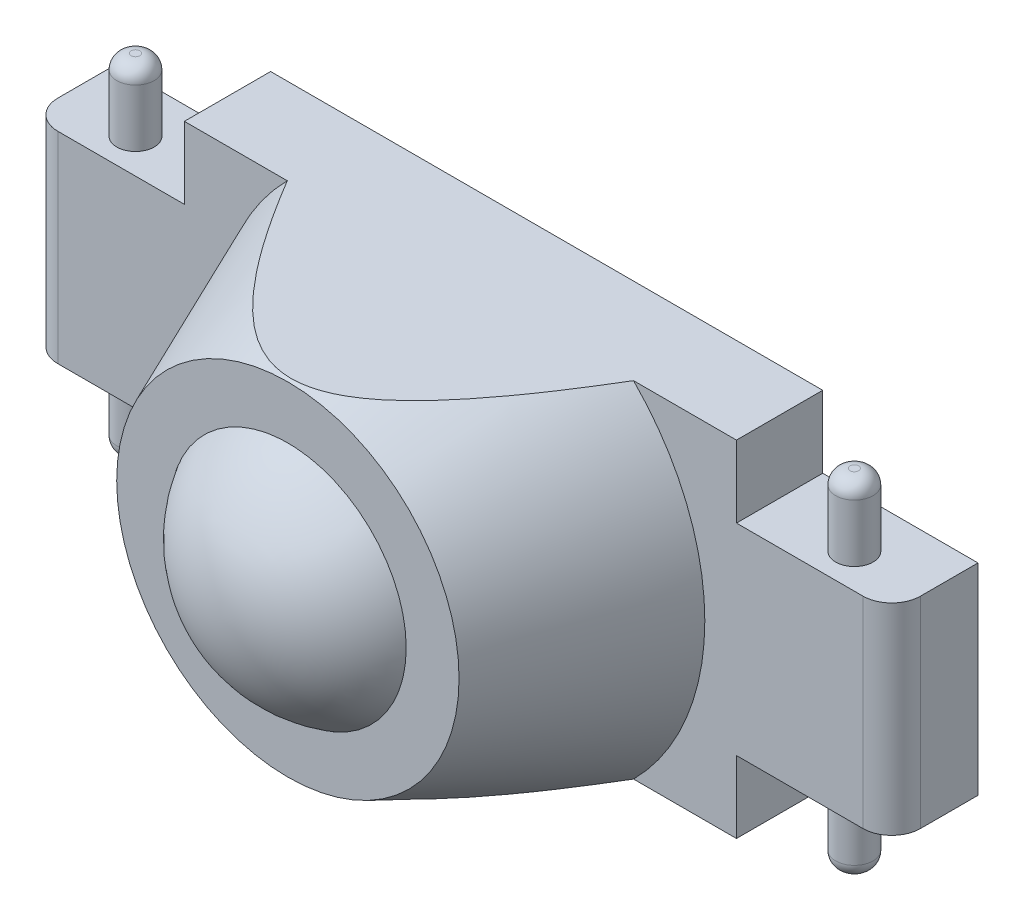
ISO-10303-21;
HEADER;
FILE_DESCRIPTION(('STEP AP214'),'2;1');
FILE_NAME('part.step','',(''),(''),'','','');
FILE_SCHEMA(('AUTOMOTIVE_DESIGN { 1 0 10303 214 1 1 1 1 }'));
ENDSEC;
DATA;
#1=APPLICATION_CONTEXT('core data for automotive mechanical design processes');
#2=APPLICATION_PROTOCOL_DEFINITION('international standard','automotive_design',2000,#1);
#3=PRODUCT_CONTEXT('',#1,'mechanical');
#4=PRODUCT('Part','Part','',(#3));
#5=PRODUCT_RELATED_PRODUCT_CATEGORY('part','',(#4));
#6=PRODUCT_DEFINITION_FORMATION('','',#4);
#7=PRODUCT_DEFINITION_CONTEXT('part definition',#1,'design');
#8=PRODUCT_DEFINITION('design','',#6,#7);
#9=PRODUCT_DEFINITION_SHAPE('','',#8);
#10=(LENGTH_UNIT() NAMED_UNIT(*) SI_UNIT(.MILLI.,.METRE.));
#11=(NAMED_UNIT(*) PLANE_ANGLE_UNIT() SI_UNIT($,.RADIAN.));
#12=(NAMED_UNIT(*) SI_UNIT($,.STERADIAN.) SOLID_ANGLE_UNIT());
#13=UNCERTAINTY_MEASURE_WITH_UNIT(LENGTH_MEASURE(1.E-05),#10,'distance_accuracy_value','');
#14=(GEOMETRIC_REPRESENTATION_CONTEXT(3) GLOBAL_UNCERTAINTY_ASSIGNED_CONTEXT((#13)) GLOBAL_UNIT_ASSIGNED_CONTEXT((#10,
#11,#12)) REPRESENTATION_CONTEXT('',''));
#15=CARTESIAN_POINT('',(0.,0.,0.));
#16=DIRECTION('',(0.,0.,1.));
#17=DIRECTION('',(1.,0.,0.));
#18=AXIS2_PLACEMENT_3D('',#15,#16,#17);
#19=CARTESIAN_POINT('',(12.5,6.,1.8));
#20=DIRECTION('',(0.,-1.,0.));
#21=DIRECTION('',(0.,0.,-1.));
#22=AXIS2_PLACEMENT_3D('',#19,#20,#21);
#23=CYLINDRICAL_SURFACE('',#22,0.649999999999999);
#24=CARTESIAN_POINT('',(12.5,-5.5,1.8));
#25=DIRECTION('',(0.,1.,0.));
#26=DIRECTION('',(0.,0.,1.));
#27=AXIS2_PLACEMENT_3D('',#24,#25,#26);
#28=CIRCLE('',#27,0.649999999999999);
#29=CARTESIAN_POINT('',(12.5,-5.5,2.45));
#30=VERTEX_POINT('',#29);
#31=EDGE_CURVE('E49',#30,#30,#28,.T.);
#32=ORIENTED_EDGE('',*,*,#31,.T.);
#33=EDGE_LOOP('',(#32));
#34=FACE_BOUND('',#33,.T.);
#35=CARTESIAN_POINT('',(12.5,5.5,1.8));
#36=DIRECTION('',(0.,1.,0.));
#37=DIRECTION('',(0.,0.,1.));
#38=AXIS2_PLACEMENT_3D('',#35,#36,#37);
#39=CIRCLE('',#38,0.649999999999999);
#40=CARTESIAN_POINT('',(12.5,5.5,2.45));
#41=VERTEX_POINT('',#40);
#42=EDGE_CURVE('E53',#41,#41,#39,.F.);
#43=ORIENTED_EDGE('',*,*,#42,.T.);
#44=EDGE_LOOP('',(#43));
#45=FACE_BOUND('',#44,.T.);
#46=ADVANCED_FACE('F38',(#34,#45),#23,.T.);
#47=CARTESIAN_POINT('',(12.5,6.,1.8));
#48=DIRECTION('',(0.,1.,0.));
#49=DIRECTION('',(0.,0.,1.));
#50=AXIS2_PLACEMENT_3D('',#47,#48,#49);
#51=PLANE('',#50);
#52=CARTESIAN_POINT('',(12.5,6.,1.8));
#53=DIRECTION('',(0.,1.,0.));
#54=DIRECTION('',(0.,0.,1.));
#55=AXIS2_PLACEMENT_3D('',#52,#53,#54);
#56=CIRCLE('',#55,0.149999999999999);
#57=CARTESIAN_POINT('',(12.5,6.,1.95));
#58=VERTEX_POINT('',#57);
#59=EDGE_CURVE('E11',#58,#58,#56,.T.);
#60=ORIENTED_EDGE('',*,*,#59,.T.);
#61=EDGE_LOOP('',(#60));
#62=FACE_BOUND('',#61,.T.);
#63=ADVANCED_FACE('F69',(#62),#51,.T.);
#64=CARTESIAN_POINT('',(12.5,-6.,1.8));
#65=DIRECTION('',(0.,1.,0.));
#66=DIRECTION('',(0.,0.,1.));
#67=AXIS2_PLACEMENT_3D('',#64,#65,#66);
#68=PLANE('',#67);
#69=CARTESIAN_POINT('',(12.5,-6.,1.8));
#70=DIRECTION('',(0.,1.,0.));
#71=DIRECTION('',(0.,0.,1.));
#72=AXIS2_PLACEMENT_3D('',#69,#70,#71);
#73=CIRCLE('',#72,0.149999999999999);
#74=CARTESIAN_POINT('',(12.5,-6.,1.95));
#75=VERTEX_POINT('',#74);
#76=EDGE_CURVE('E45',#75,#75,#73,.F.);
#77=ORIENTED_EDGE('',*,*,#76,.T.);
#78=EDGE_LOOP('',(#77));
#79=FACE_BOUND('',#78,.T.);
#80=ADVANCED_FACE('F66',(#79),#68,.F.);
#81=CARTESIAN_POINT('',(12.5,-5.5,1.8));
#82=DIRECTION('',(0.,1.,0.));
#83=DIRECTION('',(0.,0.,1.));
#84=AXIS2_PLACEMENT_3D('',#81,#82,#83);
#85=DEGENERATE_TOROIDAL_SURFACE('',#84,0.149999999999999,0.5,.T.);
#86=ORIENTED_EDGE('',*,*,#76,.F.);
#87=EDGE_LOOP('',(#86));
#88=FACE_BOUND('',#87,.T.);
#89=ORIENTED_EDGE('',*,*,#31,.F.);
#90=EDGE_LOOP('',(#89));
#91=FACE_BOUND('',#90,.T.);
#92=ADVANCED_FACE('F62',(#88,#91),#85,.T.);
#93=CARTESIAN_POINT('',(12.5,5.5,1.8));
#94=DIRECTION('',(0.,1.,0.));
#95=DIRECTION('',(0.,0.,1.));
#96=AXIS2_PLACEMENT_3D('',#93,#94,#95);
#97=DEGENERATE_TOROIDAL_SURFACE('',#96,0.149999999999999,0.5,.T.);
#98=ORIENTED_EDGE('',*,*,#42,.F.);
#99=EDGE_LOOP('',(#98));
#100=FACE_BOUND('',#99,.T.);
#101=ORIENTED_EDGE('',*,*,#59,.F.);
#102=EDGE_LOOP('',(#101));
#103=FACE_BOUND('',#102,.T.);
#104=ADVANCED_FACE('F40',(#100,#103),#97,.T.);
#105=CLOSED_SHELL('',(#46,#63,#80,#92,#104));
#106=MANIFOLD_SOLID_BREP('B2',#105);
#107=CARTESIAN_POINT('',(-12.5,6.,1.8));
#108=DIRECTION('',(0.,-1.,0.));
#109=DIRECTION('',(0.,0.,-1.));
#110=AXIS2_PLACEMENT_3D('',#107,#108,#109);
#111=CYLINDRICAL_SURFACE('',#110,0.649999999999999);
#112=CARTESIAN_POINT('',(-12.5,5.5,1.8));
#113=DIRECTION('',(0.,1.,0.));
#114=DIRECTION('',(0.,0.,1.));
#115=AXIS2_PLACEMENT_3D('',#112,#113,#114);
#116=CIRCLE('',#115,0.649999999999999);
#117=CARTESIAN_POINT('',(-12.5,5.5,2.45));
#118=VERTEX_POINT('',#117);
#119=EDGE_CURVE('E124',#118,#118,#116,.F.);
#120=ORIENTED_EDGE('',*,*,#119,.T.);
#121=EDGE_LOOP('',(#120));
#122=FACE_BOUND('',#121,.T.);
#123=CARTESIAN_POINT('',(-12.5,-5.5,1.8));
#124=DIRECTION('',(0.,1.,0.));
#125=DIRECTION('',(0.,0.,1.));
#126=AXIS2_PLACEMENT_3D('',#123,#124,#125);
#127=CIRCLE('',#126,0.649999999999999);
#128=CARTESIAN_POINT('',(-12.5,-5.5,2.45));
#129=VERTEX_POINT('',#128);
#130=EDGE_CURVE('E128',#129,#129,#127,.T.);
#131=ORIENTED_EDGE('',*,*,#130,.T.);
#132=EDGE_LOOP('',(#131));
#133=FACE_BOUND('',#132,.T.);
#134=ADVANCED_FACE('F117',(#122,#133),#111,.T.);
#135=CARTESIAN_POINT('',(-12.5,6.,1.8));
#136=DIRECTION('',(0.,1.,0.));
#137=DIRECTION('',(0.,0.,1.));
#138=AXIS2_PLACEMENT_3D('',#135,#136,#137);
#139=PLANE('',#138);
#140=CARTESIAN_POINT('',(-12.5,6.,1.8));
#141=DIRECTION('',(0.,1.,0.));
#142=DIRECTION('',(0.,0.,1.));
#143=AXIS2_PLACEMENT_3D('',#140,#141,#142);
#144=CIRCLE('',#143,0.149999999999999);
#145=CARTESIAN_POINT('',(-12.5,6.,1.95));
#146=VERTEX_POINT('',#145);
#147=EDGE_CURVE('E132',#146,#146,#144,.T.);
#148=ORIENTED_EDGE('',*,*,#147,.T.);
#149=EDGE_LOOP('',(#148));
#150=FACE_BOUND('',#149,.T.);
#151=ADVANCED_FACE('F138',(#150),#139,.T.);
#152=CARTESIAN_POINT('',(-12.5,-6.,1.8));
#153=DIRECTION('',(0.,1.,0.));
#154=DIRECTION('',(0.,0.,1.));
#155=AXIS2_PLACEMENT_3D('',#152,#153,#154);
#156=PLANE('',#155);
#157=CARTESIAN_POINT('',(-12.5,-6.,1.8));
#158=DIRECTION('',(0.,1.,0.));
#159=DIRECTION('',(0.,0.,1.));
#160=AXIS2_PLACEMENT_3D('',#157,#158,#159);
#161=CIRCLE('',#160,0.149999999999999);
#162=CARTESIAN_POINT('',(-12.5,-6.,1.95));
#163=VERTEX_POINT('',#162);
#164=EDGE_CURVE('E37',#163,#163,#161,.F.);
#165=ORIENTED_EDGE('',*,*,#164,.T.);
#166=EDGE_LOOP('',(#165));
#167=FACE_BOUND('',#166,.T.);
#168=ADVANCED_FACE('F142',(#167),#156,.F.);
#169=CARTESIAN_POINT('',(-12.5,5.5,1.8));
#170=DIRECTION('',(0.,1.,0.));
#171=DIRECTION('',(0.,0.,1.));
#172=AXIS2_PLACEMENT_3D('',#169,#170,#171);
#173=DEGENERATE_TOROIDAL_SURFACE('',#172,0.149999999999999,0.5,.T.);
#174=ORIENTED_EDGE('',*,*,#119,.F.);
#175=EDGE_LOOP('',(#174));
#176=FACE_BOUND('',#175,.T.);
#177=ORIENTED_EDGE('',*,*,#147,.F.);
#178=EDGE_LOOP('',(#177));
#179=FACE_BOUND('',#178,.T.);
#180=ADVANCED_FACE('F140',(#176,#179),#173,.T.);
#181=CARTESIAN_POINT('',(-12.5,-5.5,1.8));
#182=DIRECTION('',(0.,1.,0.));
#183=DIRECTION('',(0.,0.,1.));
#184=AXIS2_PLACEMENT_3D('',#181,#182,#183);
#185=DEGENERATE_TOROIDAL_SURFACE('',#184,0.149999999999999,0.5,.T.);
#186=ORIENTED_EDGE('',*,*,#164,.F.);
#187=EDGE_LOOP('',(#186));
#188=FACE_BOUND('',#187,.T.);
#189=ORIENTED_EDGE('',*,*,#130,.F.);
#190=EDGE_LOOP('',(#189));
#191=FACE_BOUND('',#190,.T.);
#192=ADVANCED_FACE('F119',(#188,#191),#185,.T.);
#193=CLOSED_SHELL('',(#134,#151,#168,#180,#192));
#194=MANIFOLD_SOLID_BREP('B6',#193);
#195=CARTESIAN_POINT('',(0.,0.,2.29999999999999));
#196=DIRECTION('',(0.,0.,1.));
#197=DIRECTION('',(1.,0.,0.));
#198=AXIS2_PLACEMENT_3D('',#195,#196,#197);
#199=TOROIDAL_SURFACE('',#198,4.275,0.5);
#200=CARTESIAN_POINT('',(0.,0.,2.29999999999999));
#201=DIRECTION('',(0.,0.,1.));
#202=DIRECTION('',(1.,0.,0.));
#203=AXIS2_PLACEMENT_3D('',#200,#201,#202);
#204=CIRCLE('',#203,4.775);
#205=CARTESIAN_POINT('',(4.775,0.,2.29999999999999));
#206=VERTEX_POINT('',#205);
#207=EDGE_CURVE('E116',#206,#206,#204,.T.);
#208=ORIENTED_EDGE('',*,*,#207,.F.);
#209=EDGE_LOOP('',(#208));
#210=FACE_BOUND('',#209,.T.);
#211=CARTESIAN_POINT('',(0.,0.,1.79999999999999));
#212=DIRECTION('',(0.,0.,1.));
#213=DIRECTION('',(1.,0.,0.));
#214=AXIS2_PLACEMENT_3D('',#211,#212,#213);
#215=CIRCLE('',#214,4.275);
#216=CARTESIAN_POINT('',(4.275,0.,1.79999999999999));
#217=VERTEX_POINT('',#216);
#218=EDGE_CURVE('E207',#217,#217,#215,.T.);
#219=ORIENTED_EDGE('',*,*,#218,.T.);
#220=EDGE_LOOP('',(#219));
#221=FACE_BOUND('',#220,.T.);
#222=ADVANCED_FACE('F197',(#210,#221),#199,.T.);
#223=CARTESIAN_POINT('',(0.,0.,11.35));
#224=DIRECTION('',(0.,0.,1.));
#225=DIRECTION('',(1.,0.,0.));
#226=AXIS2_PLACEMENT_3D('',#223,#224,#225);
#227=CYLINDRICAL_SURFACE('',#226,4.775);
#228=CARTESIAN_POINT('',(0.,0.,6.57499999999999));
#229=DIRECTION('',(0.,0.,1.));
#230=DIRECTION('',(1.,0.,0.));
#231=AXIS2_PLACEMENT_3D('',#228,#229,#230);
#232=CIRCLE('',#231,4.775);
#233=CARTESIAN_POINT('',(4.775,0.,6.57499999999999));
#234=VERTEX_POINT('',#233);
#235=EDGE_CURVE('E203',#234,#234,#232,.T.);
#236=ORIENTED_EDGE('',*,*,#235,.F.);
#237=EDGE_LOOP('',(#236));
#238=FACE_BOUND('',#237,.T.);
#239=ORIENTED_EDGE('',*,*,#207,.T.);
#240=EDGE_LOOP('',(#239));
#241=FACE_BOUND('',#240,.T.);
#242=ADVANCED_FACE('F222',(#238,#241),#227,.T.);
#243=CARTESIAN_POINT('',(0.,0.,6.575));
#244=DIRECTION('',(0.,0.,1.));
#245=DIRECTION('',(-1.,0.,0.));
#246=AXIS2_PLACEMENT_3D('',#243,#244,#245);
#247=SPHERICAL_SURFACE('',#246,4.775);
#248=ORIENTED_EDGE('',*,*,#235,.T.);
#249=EDGE_LOOP('',(#248));
#250=FACE_BOUND('',#249,.T.);
#251=ADVANCED_FACE('F217',(#250),#247,.T.);
#252=CARTESIAN_POINT('',(0.,0.,1.79999999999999));
#253=DIRECTION('',(0.,0.,1.));
#254=DIRECTION('',(1.,0.,0.));
#255=AXIS2_PLACEMENT_3D('',#252,#253,#254);
#256=PLANE('',#255);
#257=ORIENTED_EDGE('',*,*,#218,.F.);
#258=EDGE_LOOP('',(#257));
#259=FACE_BOUND('',#258,.T.);
#260=ADVANCED_FACE('F215',(#259),#256,.F.);
#261=CLOSED_SHELL('',(#222,#242,#251,#260));
#262=MANIFOLD_SOLID_BREP('B32',#261);
#263=CARTESIAN_POINT('',(-15.,-3.5,3.));
#264=DIRECTION('',(0.,0.,1.));
#265=DIRECTION('',(1.,0.,0.));
#266=AXIS2_PLACEMENT_3D('',#263,#264,#265);
#267=PLANE('',#266);
#268=DIRECTION('',(-1.,0.,0.));
#269=VECTOR('',#268,1.);
#270=CARTESIAN_POINT('',(-15.,3.5,3.));
#271=LINE('',#270,#269);
#272=CARTESIAN_POINT('',(-9.6,3.5,3.));
#273=VERTEX_POINT('',#272);
#274=CARTESIAN_POINT('',(-14.,3.5,3.));
#275=VERTEX_POINT('',#274);
#276=EDGE_CURVE('E410',#273,#275,#271,.T.);
#277=ORIENTED_EDGE('',*,*,#276,.T.);
#278=DIRECTION('',(0.,-1.,0.));
#279=VECTOR('',#278,1.);
#280=CARTESIAN_POINT('',(-14.,-3.5,3.));
#281=LINE('',#280,#279);
#282=CARTESIAN_POINT('',(-14.,-3.5,3.));
#283=VERTEX_POINT('',#282);
#284=EDGE_CURVE('E482',#275,#283,#281,.T.);
#285=ORIENTED_EDGE('',*,*,#284,.T.);
#286=DIRECTION('',(1.,0.,0.));
#287=VECTOR('',#286,1.);
#288=CARTESIAN_POINT('',(-15.,-3.5,3.));
#289=LINE('',#288,#287);
#290=CARTESIAN_POINT('',(-9.6,-3.5,3.));
#291=VERTEX_POINT('',#290);
#292=EDGE_CURVE('E395',#283,#291,#289,.T.);
#293=ORIENTED_EDGE('',*,*,#292,.T.);
#294=DIRECTION('',(0.,-1.,0.));
#295=VECTOR('',#294,1.);
#296=CARTESIAN_POINT('',(-9.6,-3.5,3.));
#297=LINE('',#296,#295);
#298=CARTESIAN_POINT('',(-9.6,-6.,3.));
#299=VERTEX_POINT('',#298);
#300=EDGE_CURVE('E392',#291,#299,#297,.T.);
#301=ORIENTED_EDGE('',*,*,#300,.T.);
#302=DIRECTION('',(1.,0.,0.));
#303=VECTOR('',#302,1.);
#304=CARTESIAN_POINT('',(-9.6,-6.,3.));
#305=LINE('',#304,#303);
#306=CARTESIAN_POINT('',(-6.02079728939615,-6.,3.));
#307=VERTEX_POINT('',#306);
#308=EDGE_CURVE('E391',#299,#307,#305,.T.);
#309=ORIENTED_EDGE('',*,*,#308,.T.);
#310=CARTESIAN_POINT('',(0.,0.,3.));
#311=DIRECTION('',(0.,0.,1.));
#312=DIRECTION('',(1.,0.,0.));
#313=AXIS2_PLACEMENT_3D('',#310,#311,#312);
#314=CIRCLE('',#313,8.5);
#315=CARTESIAN_POINT('',(-6.02079728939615,6.,3.));
#316=VERTEX_POINT('',#315);
#317=EDGE_CURVE('E369',#316,#307,#314,.T.);
#318=ORIENTED_EDGE('',*,*,#317,.F.);
#319=DIRECTION('',(-1.,0.,0.));
#320=VECTOR('',#319,1.);
#321=CARTESIAN_POINT('',(-9.6,6.,3.));
#322=LINE('',#321,#320);
#323=CARTESIAN_POINT('',(-9.6,6.,3.));
#324=VERTEX_POINT('',#323);
#325=EDGE_CURVE('E406',#316,#324,#322,.T.);
#326=ORIENTED_EDGE('',*,*,#325,.T.);
#327=DIRECTION('',(0.,-1.,0.));
#328=VECTOR('',#327,1.);
#329=CARTESIAN_POINT('',(-9.6,6.,3.));
#330=LINE('',#329,#328);
#331=EDGE_CURVE('E408',#324,#273,#330,.T.);
#332=ORIENTED_EDGE('',*,*,#331,.T.);
#333=EDGE_LOOP('',(#277,#285,#293,#301,#309,#318,#326,#332));
#334=FACE_BOUND('',#333,.T.);
#335=ADVANCED_FACE('F253',(#334),#267,.T.);
#336=DIRECTION('',(1.,0.,0.));
#337=VECTOR('',#336,1.);
#338=CARTESIAN_POINT('',(9.6,-3.5,3.));
#339=LINE('',#338,#337);
#340=CARTESIAN_POINT('',(9.6,-3.5,3.));
#341=VERTEX_POINT('',#340);
#342=CARTESIAN_POINT('',(14.,-3.5,3.));
#343=VERTEX_POINT('',#342);
#344=EDGE_CURVE('E400',#341,#343,#339,.T.);
#345=ORIENTED_EDGE('',*,*,#344,.T.);
#346=DIRECTION('',(0.,1.,0.));
#347=VECTOR('',#346,1.);
#348=CARTESIAN_POINT('',(14.,3.5,3.));
#349=LINE('',#348,#347);
#350=CARTESIAN_POINT('',(14.,3.5,3.));
#351=VERTEX_POINT('',#350);
#352=EDGE_CURVE('E491',#343,#351,#349,.T.);
#353=ORIENTED_EDGE('',*,*,#352,.T.);
#354=DIRECTION('',(-1.,0.,0.));
#355=VECTOR('',#354,1.);
#356=CARTESIAN_POINT('',(9.6,3.5,3.));
#357=LINE('',#356,#355);
#358=CARTESIAN_POINT('',(9.6,3.5,3.));
#359=VERTEX_POINT('',#358);
#360=EDGE_CURVE('E402',#351,#359,#357,.T.);
#361=ORIENTED_EDGE('',*,*,#360,.T.);
#362=DIRECTION('',(0.,1.,0.));
#363=VECTOR('',#362,1.);
#364=CARTESIAN_POINT('',(9.6,6.,3.));
#365=LINE('',#364,#363);
#366=CARTESIAN_POINT('',(9.6,6.,3.));
#367=VERTEX_POINT('',#366);
#368=EDGE_CURVE('E404',#359,#367,#365,.T.);
#369=ORIENTED_EDGE('',*,*,#368,.T.);
#370=CARTESIAN_POINT('',(6.02079728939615,6.,3.));
#371=VERTEX_POINT('',#370);
#372=EDGE_CURVE('E384',#367,#371,#322,.T.);
#373=ORIENTED_EDGE('',*,*,#372,.T.);
#374=CARTESIAN_POINT('',(6.02079728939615,-6.,3.));
#375=VERTEX_POINT('',#374);
#376=EDGE_CURVE('E367',#375,#371,#314,.T.);
#377=ORIENTED_EDGE('',*,*,#376,.F.);
#378=CARTESIAN_POINT('',(9.6,-6.,3.));
#379=VERTEX_POINT('',#378);
#380=EDGE_CURVE('E381',#375,#379,#305,.T.);
#381=ORIENTED_EDGE('',*,*,#380,.T.);
#382=DIRECTION('',(0.,1.,0.));
#383=VECTOR('',#382,1.);
#384=CARTESIAN_POINT('',(9.6,-3.5,3.));
#385=LINE('',#384,#383);
#386=EDGE_CURVE('E394',#379,#341,#385,.T.);
#387=ORIENTED_EDGE('',*,*,#386,.T.);
#388=EDGE_LOOP('',(#345,#353,#361,#369,#373,#377,#381,#387));
#389=FACE_BOUND('',#388,.T.);
#390=ADVANCED_FACE('F380',(#389),#267,.T.);
#391=CARTESIAN_POINT('',(-15.,-3.5,0.));
#392=DIRECTION('',(0.,0.,1.));
#393=DIRECTION('',(1.,0.,0.));
#394=AXIS2_PLACEMENT_3D('',#391,#392,#393);
#395=PLANE('',#394);
#396=DIRECTION('',(0.,-1.,0.));
#397=VECTOR('',#396,1.);
#398=CARTESIAN_POINT('',(-15.,3.5,0.));
#399=LINE('',#398,#397);
#400=CARTESIAN_POINT('',(-15.,3.5,0.));
#401=VERTEX_POINT('',#400);
#402=CARTESIAN_POINT('',(-15.,-3.5,0.));
#403=VERTEX_POINT('',#402);
#404=EDGE_CURVE('E414',#401,#403,#399,.T.);
#405=ORIENTED_EDGE('',*,*,#404,.F.);
#406=DIRECTION('',(-1.,0.,0.));
#407=VECTOR('',#406,1.);
#408=CARTESIAN_POINT('',(-15.,3.5,0.));
#409=LINE('',#408,#407);
#410=CARTESIAN_POINT('',(-9.6,3.5,0.));
#411=VERTEX_POINT('',#410);
#412=EDGE_CURVE('E440',#411,#401,#409,.T.);
#413=ORIENTED_EDGE('',*,*,#412,.F.);
#414=DIRECTION('',(0.,-1.,0.));
#415=VECTOR('',#414,1.);
#416=CARTESIAN_POINT('',(-9.6,6.,0.));
#417=LINE('',#416,#415);
#418=CARTESIAN_POINT('',(-9.6,6.,0.));
#419=VERTEX_POINT('',#418);
#420=EDGE_CURVE('E438',#419,#411,#417,.T.);
#421=ORIENTED_EDGE('',*,*,#420,.F.);
#422=DIRECTION('',(-1.,0.,0.));
#423=VECTOR('',#422,1.);
#424=CARTESIAN_POINT('',(-9.6,6.,0.));
#425=LINE('',#424,#423);
#426=CARTESIAN_POINT('',(9.6,6.,0.));
#427=VERTEX_POINT('',#426);
#428=EDGE_CURVE('E436',#427,#419,#425,.T.);
#429=ORIENTED_EDGE('',*,*,#428,.F.);
#430=DIRECTION('',(0.,1.,0.));
#431=VECTOR('',#430,1.);
#432=CARTESIAN_POINT('',(9.6,6.,0.));
#433=LINE('',#432,#431);
#434=CARTESIAN_POINT('',(9.6,3.5,0.));
#435=VERTEX_POINT('',#434);
#436=EDGE_CURVE('E434',#435,#427,#433,.T.);
#437=ORIENTED_EDGE('',*,*,#436,.F.);
#438=DIRECTION('',(-1.,0.,0.));
#439=VECTOR('',#438,1.);
#440=CARTESIAN_POINT('',(9.6,3.5,0.));
#441=LINE('',#440,#439);
#442=CARTESIAN_POINT('',(15.,3.5,0.));
#443=VERTEX_POINT('',#442);
#444=EDGE_CURVE('E432',#443,#435,#441,.T.);
#445=ORIENTED_EDGE('',*,*,#444,.F.);
#446=DIRECTION('',(0.,1.,0.));
#447=VECTOR('',#446,1.);
#448=CARTESIAN_POINT('',(15.,3.5,0.));
#449=LINE('',#448,#447);
#450=CARTESIAN_POINT('',(15.,-3.5,0.));
#451=VERTEX_POINT('',#450);
#452=EDGE_CURVE('E429',#451,#443,#449,.T.);
#453=ORIENTED_EDGE('',*,*,#452,.F.);
#454=DIRECTION('',(1.,0.,0.));
#455=VECTOR('',#454,1.);
#456=CARTESIAN_POINT('',(9.6,-3.5,0.));
#457=LINE('',#456,#455);
#458=CARTESIAN_POINT('',(9.6,-3.5,0.));
#459=VERTEX_POINT('',#458);
#460=EDGE_CURVE('E426',#459,#451,#457,.T.);
#461=ORIENTED_EDGE('',*,*,#460,.F.);
#462=DIRECTION('',(0.,1.,0.));
#463=VECTOR('',#462,1.);
#464=CARTESIAN_POINT('',(9.6,-3.5,0.));
#465=LINE('',#464,#463);
#466=CARTESIAN_POINT('',(9.6,-6.,0.));
#467=VERTEX_POINT('',#466);
#468=EDGE_CURVE('E424',#467,#459,#465,.T.);
#469=ORIENTED_EDGE('',*,*,#468,.F.);
#470=DIRECTION('',(1.,0.,0.));
#471=VECTOR('',#470,1.);
#472=CARTESIAN_POINT('',(-9.6,-6.,0.));
#473=LINE('',#472,#471);
#474=CARTESIAN_POINT('',(-9.6,-6.,0.));
#475=VERTEX_POINT('',#474);
#476=EDGE_CURVE('E422',#475,#467,#473,.T.);
#477=ORIENTED_EDGE('',*,*,#476,.F.);
#478=DIRECTION('',(0.,-1.,0.));
#479=VECTOR('',#478,1.);
#480=CARTESIAN_POINT('',(-9.6,-3.5,0.));
#481=LINE('',#480,#479);
#482=CARTESIAN_POINT('',(-9.6,-3.5,0.));
#483=VERTEX_POINT('',#482);
#484=EDGE_CURVE('E420',#483,#475,#481,.T.);
#485=ORIENTED_EDGE('',*,*,#484,.F.);
#486=DIRECTION('',(1.,0.,0.));
#487=VECTOR('',#486,1.);
#488=CARTESIAN_POINT('',(-15.,-3.5,0.));
#489=LINE('',#488,#487);
#490=EDGE_CURVE('E417',#403,#483,#489,.T.);
#491=ORIENTED_EDGE('',*,*,#490,.F.);
#492=EDGE_LOOP('',(#405,#413,#421,#429,#437,#445,#453,#461,#469,#477,#485,#491));
#493=FACE_BOUND('',#492,.T.);
#494=CARTESIAN_POINT('',(0.,0.,0.));
#495=DIRECTION('',(0.,0.,1.));
#496=DIRECTION('',(1.,0.,0.));
#497=AXIS2_PLACEMENT_3D('',#494,#495,#496);
#498=CIRCLE('',#497,4.775);
#499=CARTESIAN_POINT('',(4.775,0.,0.));
#500=VERTEX_POINT('',#499);
#501=EDGE_CURVE('E418',#500,#500,#498,.T.);
#502=ORIENTED_EDGE('',*,*,#501,.T.);
#503=EDGE_LOOP('',(#502));
#504=FACE_BOUND('',#503,.T.);
#505=ADVANCED_FACE('F541',(#493,#504),#395,.F.);
#506=CARTESIAN_POINT('',(-15.,3.5,3.));
#507=DIRECTION('',(1.,0.,0.));
#508=DIRECTION('',(0.,0.,-1.));
#509=AXIS2_PLACEMENT_3D('',#506,#507,#508);
#510=PLANE('',#509);
#511=DIRECTION('',(0.,0.,-1.));
#512=VECTOR('',#511,1.);
#513=CARTESIAN_POINT('',(-15.,-3.5,3.));
#514=LINE('',#513,#512);
#515=CARTESIAN_POINT('',(-15.,-3.5,2.));
#516=VERTEX_POINT('',#515);
#517=EDGE_CURVE('E385',#516,#403,#514,.T.);
#518=ORIENTED_EDGE('',*,*,#517,.F.);
#519=DIRECTION('',(0.,-1.,0.));
#520=VECTOR('',#519,1.);
#521=CARTESIAN_POINT('',(-15.,3.5,2.));
#522=LINE('',#521,#520);
#523=CARTESIAN_POINT('',(-15.,3.5,2.));
#524=VERTEX_POINT('',#523);
#525=EDGE_CURVE('E487',#516,#524,#522,.F.);
#526=ORIENTED_EDGE('',*,*,#525,.T.);
#527=DIRECTION('',(0.,0.,-1.));
#528=VECTOR('',#527,1.);
#529=CARTESIAN_POINT('',(-15.,3.5,3.));
#530=LINE('',#529,#528);
#531=EDGE_CURVE('E413',#524,#401,#530,.T.);
#532=ORIENTED_EDGE('',*,*,#531,.T.);
#533=ORIENTED_EDGE('',*,*,#404,.T.);
#534=EDGE_LOOP('',(#518,#526,#532,#533));
#535=FACE_BOUND('',#534,.T.);
#536=ADVANCED_FACE('F544',(#535),#510,.F.);
#537=CARTESIAN_POINT('',(-15.,-3.5,3.));
#538=DIRECTION('',(0.,1.,0.));
#539=DIRECTION('',(-1.,0.,0.));
#540=AXIS2_PLACEMENT_3D('',#537,#538,#539);
#541=PLANE('',#540);
#542=CARTESIAN_POINT('',(-12.5,-3.5,1.8));
#543=DIRECTION('',(0.,1.,0.));
#544=DIRECTION('',(-1.,0.,0.));
#545=AXIS2_PLACEMENT_3D('',#542,#543,#544);
#546=CIRCLE('',#545,0.649999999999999);
#547=CARTESIAN_POINT('',(-13.15,-3.5,1.8));
#548=VERTEX_POINT('',#547);
#549=EDGE_CURVE('E477',#548,#548,#546,.T.);
#550=ORIENTED_EDGE('',*,*,#549,.T.);
#551=EDGE_LOOP('',(#550));
#552=FACE_BOUND('',#551,.T.);
#553=ORIENTED_EDGE('',*,*,#292,.F.);
#554=CARTESIAN_POINT('',(-14.,-3.5,2.));
#555=DIRECTION('',(0.,1.,0.));
#556=DIRECTION('',(-1.,0.,0.));
#557=AXIS2_PLACEMENT_3D('',#554,#555,#556);
#558=CIRCLE('',#557,1.);
#559=EDGE_CURVE('E485',#283,#516,#558,.F.);
#560=ORIENTED_EDGE('',*,*,#559,.T.);
#561=ORIENTED_EDGE('',*,*,#517,.T.);
#562=ORIENTED_EDGE('',*,*,#490,.T.);
#563=DIRECTION('',(0.,0.,-1.));
#564=VECTOR('',#563,1.);
#565=CARTESIAN_POINT('',(-9.6,-3.5,3.));
#566=LINE('',#565,#564);
#567=EDGE_CURVE('E467',#291,#483,#566,.T.);
#568=ORIENTED_EDGE('',*,*,#567,.F.);
#569=EDGE_LOOP('',(#553,#560,#561,#562,#568));
#570=FACE_BOUND('',#569,.T.);
#571=ADVANCED_FACE('F576',(#552,#570),#541,.F.);
#572=CARTESIAN_POINT('',(-9.6,-3.5,3.));
#573=DIRECTION('',(1.,0.,0.));
#574=DIRECTION('',(0.,0.,-1.));
#575=AXIS2_PLACEMENT_3D('',#572,#573,#574);
#576=PLANE('',#575);
#577=ORIENTED_EDGE('',*,*,#484,.T.);
#578=DIRECTION('',(0.,0.,-1.));
#579=VECTOR('',#578,1.);
#580=CARTESIAN_POINT('',(-9.6,-6.,3.));
#581=LINE('',#580,#579);
#582=EDGE_CURVE('E464',#299,#475,#581,.T.);
#583=ORIENTED_EDGE('',*,*,#582,.F.);
#584=ORIENTED_EDGE('',*,*,#300,.F.);
#585=ORIENTED_EDGE('',*,*,#567,.T.);
#586=EDGE_LOOP('',(#577,#583,#584,#585));
#587=FACE_BOUND('',#586,.T.);
#588=ADVANCED_FACE('F573',(#587),#576,.F.);
#589=CARTESIAN_POINT('',(-9.6,-6.,3.));
#590=DIRECTION('',(0.,1.,0.));
#591=DIRECTION('',(0.,0.,1.));
#592=AXIS2_PLACEMENT_3D('',#589,#590,#591);
#593=PLANE('',#592);
#594=ORIENTED_EDGE('',*,*,#476,.T.);
#595=DIRECTION('',(0.,0.,-1.));
#596=VECTOR('',#595,1.);
#597=CARTESIAN_POINT('',(9.6,-6.,3.));
#598=LINE('',#597,#596);
#599=EDGE_CURVE('E389',#379,#467,#598,.T.);
#600=ORIENTED_EDGE('',*,*,#599,.F.);
#601=ORIENTED_EDGE('',*,*,#380,.F.);
#602=CARTESIAN_POINT('',(-10.2872681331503,-6.,-5.03145725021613));
#603=CARTESIAN_POINT('',(-10.0843845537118,-6.,-4.61864594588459));
#604=CARTESIAN_POINT('',(-9.88031724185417,-6.,-4.20641125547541));
#605=CARTESIAN_POINT('',(-9.46924577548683,-6.,-3.38337467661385));
#606=CARTESIAN_POINT('',(-9.26224142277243,-6.,-2.97257288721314));
#607=CARTESIAN_POINT('',(-8.84422043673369,-6.,-2.15169024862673));
#608=CARTESIAN_POINT('',(-8.63319490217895,-6.,-1.74161392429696));
#609=CARTESIAN_POINT('',(-8.20688228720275,-6.,-0.923696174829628));
#610=CARTESIAN_POINT('',(-7.99159534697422,-6.,-0.515854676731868));
#611=CARTESIAN_POINT('',(-7.55040490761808,-6.,0.30695179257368));
#612=CARTESIAN_POINT('',(-7.32437053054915,-6.,0.721846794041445));
#613=CARTESIAN_POINT('',(-6.86526131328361,-6.,1.54771298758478));
#614=CARTESIAN_POINT('',(-6.63218672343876,-6.,1.95868431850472));
#615=CARTESIAN_POINT('',(-6.15710657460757,-6.,2.77490284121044));
#616=CARTESIAN_POINT('',(-5.91511054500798,-6.,3.18015553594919));
#617=CARTESIAN_POINT('',(-5.54286768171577,-6.,3.7822735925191));
#618=CARTESIAN_POINT('',(-5.41725545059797,-6.,3.98200404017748));
#619=CARTESIAN_POINT('',(-5.16237126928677,-6.,4.37911243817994));
#620=CARTESIAN_POINT('',(-5.03309944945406,-6.,4.57649047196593));
#621=CARTESIAN_POINT('',(-4.76244621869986,-6.,4.9798901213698));
#622=CARTESIAN_POINT('',(-4.62080028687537,-6.,5.1857348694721));
#623=CARTESIAN_POINT('',(-4.33151619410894,-6.,5.59325657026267));
#624=CARTESIAN_POINT('',(-4.18387679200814,-6.,5.79493264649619));
#625=CARTESIAN_POINT('',(-3.88148781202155,-6.,6.19231265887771));
#626=CARTESIAN_POINT('',(-3.7267520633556,-6.,6.38802706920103));
#627=CARTESIAN_POINT('',(-3.40803884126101,-6.,6.77176936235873));
#628=CARTESIAN_POINT('',(-3.24406468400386,-6.,6.95979996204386));
#629=CARTESIAN_POINT('',(-2.97726458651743,-6.,7.24638717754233));
#630=CARTESIAN_POINT('',(-2.87844416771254,-6.,7.34866844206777));
#631=CARTESIAN_POINT('',(-2.67632833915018,-6.,7.54869391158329));
#632=CARTESIAN_POINT('',(-2.5730338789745,-6.,7.64643907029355));
#633=CARTESIAN_POINT('',(-2.36129472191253,-6.,7.83614144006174));
#634=CARTESIAN_POINT('',(-2.25285218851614,-6.,7.92810104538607));
#635=CARTESIAN_POINT('',(-2.03006875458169,-6.,8.104519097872));
#636=CARTESIAN_POINT('',(-1.91573031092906,-6.,8.18898063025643));
#637=CARTESIAN_POINT('',(-1.64238555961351,-6.,8.37385345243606));
#638=CARTESIAN_POINT('',(-1.48085888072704,-6.,8.47063315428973));
#639=CARTESIAN_POINT('',(-1.1453606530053,-6.,8.63953090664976));
#640=CARTESIAN_POINT('',(-0.971417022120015,-6.,8.71170229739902));
#641=CARTESIAN_POINT('',(-0.649504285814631,-6.,8.81094983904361));
#642=CARTESIAN_POINT('',(-0.503488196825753,-6.,8.84422643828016));
#643=CARTESIAN_POINT('',(-0.207908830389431,-6.,8.88540134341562));
#644=CARTESIAN_POINT('',(-0.0583487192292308,-6.,8.89332150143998));
#645=CARTESIAN_POINT('',(0.239881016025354,-6.,8.88270573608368));
#646=CARTESIAN_POINT('',(0.388550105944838,-6.,8.86415528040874));
#647=CARTESIAN_POINT('',(0.680781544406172,-6.,8.80308488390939));
#648=CARTESIAN_POINT('',(0.824340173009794,-6.,8.76054784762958));
#649=CARTESIAN_POINT('',(1.1727766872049,-6.,8.63032715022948));
#650=CARTESIAN_POINT('',(1.37316050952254,-6.,8.53073168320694));
#651=CARTESIAN_POINT('',(1.66061850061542,-6.,8.35987516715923));
#652=CARTESIAN_POINT('',(1.75444739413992,-6.,8.29918516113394));
#653=CARTESIAN_POINT('',(1.9380678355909,-6.,8.17195529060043));
#654=CARTESIAN_POINT('',(2.02786014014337,-6.,8.10541652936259));
#655=CARTESIAN_POINT('',(2.23770550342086,-6.,7.94101899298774));
#656=CARTESIAN_POINT('',(2.3560466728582,-6.,7.84099181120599));
#657=CARTESIAN_POINT('',(2.58663438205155,-6.,7.63410009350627));
#658=CARTESIAN_POINT('',(2.69887790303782,-6.,7.52723222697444));
#659=CARTESIAN_POINT('',(2.91830995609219,-6.,7.30807653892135));
#660=CARTESIAN_POINT('',(3.02548913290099,-6.,7.19577940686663));
#661=CARTESIAN_POINT('',(3.2353663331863,-6.,6.96706748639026));
#662=CARTESIAN_POINT('',(3.33806377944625,-6.,6.85065217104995));
#663=CARTESIAN_POINT('',(3.54087933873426,-6.,6.6130599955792));
#664=CARTESIAN_POINT('',(3.6409486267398,-6.,6.49184161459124));
#665=CARTESIAN_POINT('',(3.83769624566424,-6.,6.24668512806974));
#666=CARTESIAN_POINT('',(3.93437445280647,-6.,6.12274692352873));
#667=CARTESIAN_POINT('',(4.1246753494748,-6.,5.872794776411));
#668=CARTESIAN_POINT('',(4.21830168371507,-6.,5.74678360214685));
#669=CARTESIAN_POINT('',(4.40299132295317,-6.,5.49290971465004));
#670=CARTESIAN_POINT('',(4.49405473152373,-6.,5.36504707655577));
#671=CARTESIAN_POINT('',(4.79667744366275,-6.,4.93225477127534));
#672=CARTESIAN_POINT('',(5.00312849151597,-6.,4.62374938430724));
#673=CARTESIAN_POINT('',(5.40671394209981,-6.,4.00068323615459));
#674=CARTESIAN_POINT('',(5.60384659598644,-6.,3.68612135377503));
#675=CARTESIAN_POINT('',(5.99097141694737,-6.,3.05240147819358));
#676=CARTESIAN_POINT('',(6.18095946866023,-6.,2.73324097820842));
#677=CARTESIAN_POINT('',(6.55518665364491,-6.,2.0915645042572));
#678=CARTESIAN_POINT('',(6.73942558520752,-6.,1.76904841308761));
#679=CARTESIAN_POINT('',(7.10379504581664,-6.,1.12043192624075));
#680=CARTESIAN_POINT('',(7.28391154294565,-6.,0.794323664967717));
#681=CARTESIAN_POINT('',(7.64029720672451,-6.,0.140008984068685));
#682=CARTESIAN_POINT('',(7.81656631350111,-6.,-0.18819746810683));
#683=CARTESIAN_POINT('',(8.16583323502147,-6.,-0.846194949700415));
#684=CARTESIAN_POINT('',(8.33883218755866,-6.,-1.17598537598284));
#685=CARTESIAN_POINT('',(8.68212169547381,-6.,-1.83697382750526));
#686=CARTESIAN_POINT('',(8.85241223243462,-6.,-2.16817186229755));
#687=CARTESIAN_POINT('',(9.3202274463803,-6.,-3.08583671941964));
#688=CARTESIAN_POINT('',(9.61531509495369,-6.,-3.67354588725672));
#689=CARTESIAN_POINT('',(10.1999887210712,-6.,-4.85176060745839));
#690=CARTESIAN_POINT('',(10.4895741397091,-6.,-5.44226643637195));
#691=CARTESIAN_POINT('',(11.0627264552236,-6.,-6.6220006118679));
#692=CARTESIAN_POINT('',(11.3463183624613,-6.,-7.21121682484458));
#693=CARTESIAN_POINT('',(11.9099383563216,-6.,-8.39125514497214));
#694=CARTESIAN_POINT('',(12.1899669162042,-6.,-8.98207702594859));
#695=CARTESIAN_POINT('',(12.4686289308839,-6.,-9.57353637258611));
#696=B_SPLINE_CURVE_WITH_KNOTS('',3,(#602,#603,#604,#605,#606,#607,#608,#609,#610,#611,#612,
#613,#614,#615,#616,#617,#618,#619,#620,#621,#622,#623,#624,#625,#626,#627,#628,#629,#630,#631,
#632,#633,#634,#635,#636,#637,#638,#639,#640,#641,#642,#643,#644,#645,#646,#647,#648,#649,#650,
#651,#652,#653,#654,#655,#656,#657,#658,#659,#660,#661,#662,#663,#664,#665,#666,#667,#668,#669,
#670,#671,#672,#673,#674,#675,#676,#677,#678,#679,#680,#681,#682,#683,#684,#685,#686,#687,#688,
#689,#690,#691,#692,#693,#694,#695),.UNSPECIFIED.,.F.,.F.,(4,2,2,2,2,2,2,2,2,2,2,2,2,2,2,2,2,2,
2,2,2,2,2,2,2,2,2,2,2,2,2,2,2,2,2,2,2,2,2,2,2,2,2,2,2,2,4),(0.,1.37992320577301,
2.75993998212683,4.14348325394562,5.52698108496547,6.94434102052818,8.36165061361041,
9.77748784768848,10.4852956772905,11.193078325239,11.9426088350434,12.6922953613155,
13.4405783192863,14.1885943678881,14.6151468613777,15.0416092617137,15.4678939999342,
15.894002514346,16.4574298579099,17.0196280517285,17.4669757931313,17.9139379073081,
18.3611454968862,18.8086722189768,19.4758927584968,19.8110116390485,20.1460674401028,
20.6105734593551,21.0753073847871,21.5408686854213,22.0064897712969,22.4779795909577,
22.9494866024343,23.4204081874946,23.8913107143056,25.0046771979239,26.1182518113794,
27.2324583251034,28.3467038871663,29.4643025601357,30.5819186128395,31.699138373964,
32.8163657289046,34.7892168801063,36.7622673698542,38.7239887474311,40.6854468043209),.UNSPECIFIED.);
#697=EDGE_CURVE('E364',#307,#375,#696,.T.);
#698=ORIENTED_EDGE('',*,*,#697,.F.);
#699=ORIENTED_EDGE('',*,*,#308,.F.);
#700=ORIENTED_EDGE('',*,*,#582,.T.);
#701=EDGE_LOOP('',(#594,#600,#601,#698,#699,#700));
#702=FACE_BOUND('',#701,.T.);
#703=ADVANCED_FACE('F387',(#702),#593,.F.);
#704=CARTESIAN_POINT('',(9.6,-3.5,3.));
#705=DIRECTION('',(-1.,0.,0.));
#706=DIRECTION('',(0.,-1.,0.));
#707=AXIS2_PLACEMENT_3D('',#704,#705,#706);
#708=PLANE('',#707);
#709=ORIENTED_EDGE('',*,*,#468,.T.);
#710=DIRECTION('',(0.,0.,-1.));
#711=VECTOR('',#710,1.);
#712=CARTESIAN_POINT('',(9.6,-3.5,3.));
#713=LINE('',#712,#711);
#714=EDGE_CURVE('E460',#341,#459,#713,.T.);
#715=ORIENTED_EDGE('',*,*,#714,.F.);
#716=ORIENTED_EDGE('',*,*,#386,.F.);
#717=ORIENTED_EDGE('',*,*,#599,.T.);
#718=EDGE_LOOP('',(#709,#715,#716,#717));
#719=FACE_BOUND('',#718,.T.);
#720=ADVANCED_FACE('F566',(#719),#708,.F.);
#721=CARTESIAN_POINT('',(9.6,-3.5,3.));
#722=DIRECTION('',(0.,1.,0.));
#723=DIRECTION('',(-1.,0.,0.));
#724=AXIS2_PLACEMENT_3D('',#721,#722,#723);
#725=PLANE('',#724);
#726=CARTESIAN_POINT('',(12.5,-3.5,1.8));
#727=DIRECTION('',(0.,1.,0.));
#728=DIRECTION('',(-1.,0.,0.));
#729=AXIS2_PLACEMENT_3D('',#726,#727,#728);
#730=CIRCLE('',#729,0.649999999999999);
#731=CARTESIAN_POINT('',(11.85,-3.5,1.8));
#732=VERTEX_POINT('',#731);
#733=EDGE_CURVE('E478',#732,#732,#730,.T.);
#734=ORIENTED_EDGE('',*,*,#733,.T.);
#735=EDGE_LOOP('',(#734));
#736=FACE_BOUND('',#735,.T.);
#737=DIRECTION('',(0.,0.,-1.));
#738=VECTOR('',#737,1.);
#739=CARTESIAN_POINT('',(15.,-3.5,3.));
#740=LINE('',#739,#738);
#741=CARTESIAN_POINT('',(15.,-3.5,2.));
#742=VERTEX_POINT('',#741);
#743=EDGE_CURVE('E458',#742,#451,#740,.T.);
#744=ORIENTED_EDGE('',*,*,#743,.F.);
#745=CARTESIAN_POINT('',(14.,-3.5,2.));
#746=DIRECTION('',(0.,1.,0.));
#747=DIRECTION('',(-1.,0.,0.));
#748=AXIS2_PLACEMENT_3D('',#745,#746,#747);
#749=CIRCLE('',#748,1.);
#750=EDGE_CURVE('E195',#742,#343,#749,.F.);
#751=ORIENTED_EDGE('',*,*,#750,.T.);
#752=ORIENTED_EDGE('',*,*,#344,.F.);
#753=ORIENTED_EDGE('',*,*,#714,.T.);
#754=ORIENTED_EDGE('',*,*,#460,.T.);
#755=EDGE_LOOP('',(#744,#751,#752,#753,#754));
#756=FACE_BOUND('',#755,.T.);
#757=ADVANCED_FACE('F563',(#736,#756),#725,.F.);
#758=CARTESIAN_POINT('',(15.,3.5,3.));
#759=DIRECTION('',(-1.,0.,0.));
#760=DIRECTION('',(0.,0.,1.));
#761=AXIS2_PLACEMENT_3D('',#758,#759,#760);
#762=PLANE('',#761);
#763=DIRECTION('',(0.,0.,-1.));
#764=VECTOR('',#763,1.);
#765=CARTESIAN_POINT('',(15.,3.5,3.));
#766=LINE('',#765,#764);
#767=CARTESIAN_POINT('',(15.,3.5,2.));
#768=VERTEX_POINT('',#767);
#769=EDGE_CURVE('E456',#768,#443,#766,.T.);
#770=ORIENTED_EDGE('',*,*,#769,.F.);
#771=DIRECTION('',(0.,1.,0.));
#772=VECTOR('',#771,1.);
#773=CARTESIAN_POINT('',(15.,-3.5,2.));
#774=LINE('',#773,#772);
#775=EDGE_CURVE('E261',#768,#742,#774,.F.);
#776=ORIENTED_EDGE('',*,*,#775,.T.);
#777=ORIENTED_EDGE('',*,*,#743,.T.);
#778=ORIENTED_EDGE('',*,*,#452,.T.);
#779=EDGE_LOOP('',(#770,#776,#777,#778));
#780=FACE_BOUND('',#779,.T.);
#781=ADVANCED_FACE('F559',(#780),#762,.F.);
#782=CARTESIAN_POINT('',(9.6,3.5,3.));
#783=DIRECTION('',(0.,-1.,0.));
#784=DIRECTION('',(1.,0.,0.));
#785=AXIS2_PLACEMENT_3D('',#782,#783,#784);
#786=PLANE('',#785);
#787=CARTESIAN_POINT('',(12.5,3.5,1.8));
#788=DIRECTION('',(0.,-1.,0.));
#789=DIRECTION('',(1.,0.,0.));
#790=AXIS2_PLACEMENT_3D('',#787,#788,#789);
#791=CIRCLE('',#790,0.649999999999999);
#792=CARTESIAN_POINT('',(13.15,3.5,1.8));
#793=VERTEX_POINT('',#792);
#794=EDGE_CURVE('E479',#793,#793,#791,.T.);
#795=ORIENTED_EDGE('',*,*,#794,.T.);
#796=EDGE_LOOP('',(#795));
#797=FACE_BOUND('',#796,.T.);
#798=ORIENTED_EDGE('',*,*,#360,.F.);
#799=CARTESIAN_POINT('',(14.,3.5,2.));
#800=DIRECTION('',(0.,-1.,0.));
#801=DIRECTION('',(1.,0.,0.));
#802=AXIS2_PLACEMENT_3D('',#799,#800,#801);
#803=CIRCLE('',#802,1.);
#804=EDGE_CURVE('E275',#351,#768,#803,.F.);
#805=ORIENTED_EDGE('',*,*,#804,.T.);
#806=ORIENTED_EDGE('',*,*,#769,.T.);
#807=ORIENTED_EDGE('',*,*,#444,.T.);
#808=DIRECTION('',(0.,0.,-1.));
#809=VECTOR('',#808,1.);
#810=CARTESIAN_POINT('',(9.6,3.5,3.));
#811=LINE('',#810,#809);
#812=EDGE_CURVE('E453',#359,#435,#811,.T.);
#813=ORIENTED_EDGE('',*,*,#812,.F.);
#814=EDGE_LOOP('',(#798,#805,#806,#807,#813));
#815=FACE_BOUND('',#814,.T.);
#816=ADVANCED_FACE('F499',(#797,#815),#786,.F.);
#817=CARTESIAN_POINT('',(9.6,6.,3.));
#818=DIRECTION('',(-1.,0.,0.));
#819=DIRECTION('',(0.,0.,1.));
#820=AXIS2_PLACEMENT_3D('',#817,#818,#819);
#821=PLANE('',#820);
#822=ORIENTED_EDGE('',*,*,#436,.T.);
#823=DIRECTION('',(0.,0.,-1.));
#824=VECTOR('',#823,1.);
#825=CARTESIAN_POINT('',(9.6,6.,3.));
#826=LINE('',#825,#824);
#827=EDGE_CURVE('E450',#367,#427,#826,.T.);
#828=ORIENTED_EDGE('',*,*,#827,.F.);
#829=ORIENTED_EDGE('',*,*,#368,.F.);
#830=ORIENTED_EDGE('',*,*,#812,.T.);
#831=EDGE_LOOP('',(#822,#828,#829,#830));
#832=FACE_BOUND('',#831,.T.);
#833=ADVANCED_FACE('F505',(#832),#821,.F.);
#834=CARTESIAN_POINT('',(-9.6,6.,3.));
#835=DIRECTION('',(0.,-1.,0.));
#836=DIRECTION('',(0.,0.,-1.));
#837=AXIS2_PLACEMENT_3D('',#834,#835,#836);
#838=PLANE('',#837);
#839=ORIENTED_EDGE('',*,*,#428,.T.);
#840=DIRECTION('',(0.,0.,-1.));
#841=VECTOR('',#840,1.);
#842=CARTESIAN_POINT('',(-9.6,6.,3.));
#843=LINE('',#842,#841);
#844=EDGE_CURVE('E447',#324,#419,#843,.T.);
#845=ORIENTED_EDGE('',*,*,#844,.F.);
#846=ORIENTED_EDGE('',*,*,#325,.F.);
#847=CARTESIAN_POINT('',(-10.2872681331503,6.,-5.03145725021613));
#848=CARTESIAN_POINT('',(-10.0843845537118,6.,-4.61864594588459));
#849=CARTESIAN_POINT('',(-9.88031724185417,6.,-4.20641125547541));
#850=CARTESIAN_POINT('',(-9.46924577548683,6.,-3.38337467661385));
#851=CARTESIAN_POINT('',(-9.26224142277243,6.,-2.97257288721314));
#852=CARTESIAN_POINT('',(-8.84422043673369,6.,-2.15169024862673));
#853=CARTESIAN_POINT('',(-8.63319490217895,6.,-1.74161392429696));
#854=CARTESIAN_POINT('',(-8.20688228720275,6.,-0.923696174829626));
#855=CARTESIAN_POINT('',(-7.99159534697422,6.,-0.515854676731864));
#856=CARTESIAN_POINT('',(-7.55040490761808,6.,0.306951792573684));
#857=CARTESIAN_POINT('',(-7.32437053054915,6.,0.721846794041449));
#858=CARTESIAN_POINT('',(-6.86526131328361,6.,1.54771298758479));
#859=CARTESIAN_POINT('',(-6.63218672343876,6.,1.95868431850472));
#860=CARTESIAN_POINT('',(-6.15710657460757,6.,2.77490284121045));
#861=CARTESIAN_POINT('',(-5.91511054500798,6.,3.18015553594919));
#862=CARTESIAN_POINT('',(-5.54286768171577,6.,3.78227359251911));
#863=CARTESIAN_POINT('',(-5.41725545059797,6.,3.98200404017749));
#864=CARTESIAN_POINT('',(-5.16237126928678,6.,4.37911243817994));
#865=CARTESIAN_POINT('',(-5.03309944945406,6.,4.57649047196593));
#866=CARTESIAN_POINT('',(-4.76244621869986,6.,4.9798901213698));
#867=CARTESIAN_POINT('',(-4.62080028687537,6.,5.18573486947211));
#868=CARTESIAN_POINT('',(-4.33151619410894,6.,5.59325657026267));
#869=CARTESIAN_POINT('',(-4.18387679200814,6.,5.7949326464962));
#870=CARTESIAN_POINT('',(-3.88148781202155,6.,6.19231265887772));
#871=CARTESIAN_POINT('',(-3.7267520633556,6.,6.38802706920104));
#872=CARTESIAN_POINT('',(-3.40803884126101,6.,6.77176936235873));
#873=CARTESIAN_POINT('',(-3.24406468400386,6.,6.95979996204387));
#874=CARTESIAN_POINT('',(-2.97726458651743,6.,7.24638717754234));
#875=CARTESIAN_POINT('',(-2.87844416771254,6.,7.34866844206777));
#876=CARTESIAN_POINT('',(-2.67632833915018,6.,7.5486939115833));
#877=CARTESIAN_POINT('',(-2.5730338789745,6.,7.64643907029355));
#878=CARTESIAN_POINT('',(-2.36129472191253,6.,7.83614144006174));
#879=CARTESIAN_POINT('',(-2.25285218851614,6.,7.92810104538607));
#880=CARTESIAN_POINT('',(-2.0300687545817,6.,8.104519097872));
#881=CARTESIAN_POINT('',(-1.91573031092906,6.,8.18898063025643));
#882=CARTESIAN_POINT('',(-1.64238555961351,6.,8.37385345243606));
#883=CARTESIAN_POINT('',(-1.48085888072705,6.,8.47063315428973));
#884=CARTESIAN_POINT('',(-1.1453606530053,6.,8.63953090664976));
#885=CARTESIAN_POINT('',(-0.971417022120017,6.,8.71170229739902));
#886=CARTESIAN_POINT('',(-0.649504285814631,6.,8.81094983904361));
#887=CARTESIAN_POINT('',(-0.503488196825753,6.,8.84422643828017));
#888=CARTESIAN_POINT('',(-0.207908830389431,6.,8.88540134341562));
#889=CARTESIAN_POINT('',(-0.0583487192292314,6.,8.89332150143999));
#890=CARTESIAN_POINT('',(0.239881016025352,6.,8.88270573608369));
#891=CARTESIAN_POINT('',(0.388550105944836,6.,8.86415528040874));
#892=CARTESIAN_POINT('',(0.68078154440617,6.,8.80308488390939));
#893=CARTESIAN_POINT('',(0.824340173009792,6.,8.76054784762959));
#894=CARTESIAN_POINT('',(1.17277668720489,6.,8.63032715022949));
#895=CARTESIAN_POINT('',(1.37316050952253,6.,8.53073168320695));
#896=CARTESIAN_POINT('',(1.66061850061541,6.,8.35987516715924));
#897=CARTESIAN_POINT('',(1.75444739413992,6.,8.29918516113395));
#898=CARTESIAN_POINT('',(1.9380678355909,6.,8.17195529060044));
#899=CARTESIAN_POINT('',(2.02786014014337,6.,8.1054165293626));
#900=CARTESIAN_POINT('',(2.23770550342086,6.,7.94101899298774));
#901=CARTESIAN_POINT('',(2.3560466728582,6.,7.84099181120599));
#902=CARTESIAN_POINT('',(2.58663438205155,6.,7.63410009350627));
#903=CARTESIAN_POINT('',(2.69887790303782,6.,7.52723222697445));
#904=CARTESIAN_POINT('',(2.91830995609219,6.,7.30807653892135));
#905=CARTESIAN_POINT('',(3.025489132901,6.,7.19577940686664));
#906=CARTESIAN_POINT('',(3.2353663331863,6.,6.96706748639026));
#907=CARTESIAN_POINT('',(3.33806377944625,6.,6.85065217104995));
#908=CARTESIAN_POINT('',(3.54087933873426,6.,6.61305999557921));
#909=CARTESIAN_POINT('',(3.6409486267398,6.,6.49184161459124));
#910=CARTESIAN_POINT('',(3.83769624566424,6.,6.24668512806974));
#911=CARTESIAN_POINT('',(3.93437445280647,6.,6.12274692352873));
#912=CARTESIAN_POINT('',(4.12467534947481,6.,5.872794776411));
#913=CARTESIAN_POINT('',(4.21830168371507,6.,5.74678360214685));
#914=CARTESIAN_POINT('',(4.40299132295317,6.,5.49290971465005));
#915=CARTESIAN_POINT('',(4.49405473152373,6.,5.36504707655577));
#916=CARTESIAN_POINT('',(4.79667744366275,6.,4.93225477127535));
#917=CARTESIAN_POINT('',(5.00312849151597,6.,4.62374938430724));
#918=CARTESIAN_POINT('',(5.40671394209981,6.,4.00068323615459));
#919=CARTESIAN_POINT('',(5.60384659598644,6.,3.68612135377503));
#920=CARTESIAN_POINT('',(5.99097141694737,6.,3.05240147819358));
#921=CARTESIAN_POINT('',(6.18095946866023,6.,2.73324097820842));
#922=CARTESIAN_POINT('',(6.55518665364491,6.,2.0915645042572));
#923=CARTESIAN_POINT('',(6.73942558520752,6.,1.76904841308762));
#924=CARTESIAN_POINT('',(7.10379504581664,6.,1.12043192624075));
#925=CARTESIAN_POINT('',(7.28391154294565,6.,0.79432366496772));
#926=CARTESIAN_POINT('',(7.64029720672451,6.,0.140008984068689));
#927=CARTESIAN_POINT('',(7.81656631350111,6.,-0.188197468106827));
#928=CARTESIAN_POINT('',(8.16583323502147,6.,-0.846194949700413));
#929=CARTESIAN_POINT('',(8.33883218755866,6.,-1.17598537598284));
#930=CARTESIAN_POINT('',(8.68212169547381,6.,-1.83697382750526));
#931=CARTESIAN_POINT('',(8.85241223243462,6.,-2.16817186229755));
#932=CARTESIAN_POINT('',(9.32022744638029,6.,-3.08583671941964));
#933=CARTESIAN_POINT('',(9.61531509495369,6.,-3.67354588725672));
#934=CARTESIAN_POINT('',(10.1999887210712,6.,-4.85176060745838));
#935=CARTESIAN_POINT('',(10.4895741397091,6.,-5.44226643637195));
#936=CARTESIAN_POINT('',(11.0627264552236,6.,-6.6220006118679));
#937=CARTESIAN_POINT('',(11.3463183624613,6.,-7.21121682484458));
#938=CARTESIAN_POINT('',(11.9099383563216,6.,-8.39125514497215));
#939=CARTESIAN_POINT('',(12.1899669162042,6.,-8.9820770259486));
#940=CARTESIAN_POINT('',(12.4686289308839,6.,-9.57353637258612));
#941=B_SPLINE_CURVE_WITH_KNOTS('',3,(#847,#848,#849,#850,#851,#852,#853,#854,#855,#856,#857,
#858,#859,#860,#861,#862,#863,#864,#865,#866,#867,#868,#869,#870,#871,#872,#873,#874,#875,#876,
#877,#878,#879,#880,#881,#882,#883,#884,#885,#886,#887,#888,#889,#890,#891,#892,#893,#894,#895,
#896,#897,#898,#899,#900,#901,#902,#903,#904,#905,#906,#907,#908,#909,#910,#911,#912,#913,#914,
#915,#916,#917,#918,#919,#920,#921,#922,#923,#924,#925,#926,#927,#928,#929,#930,#931,#932,#933,
#934,#935,#936,#937,#938,#939,#940),.UNSPECIFIED.,.F.,.F.,(4,2,2,2,2,2,2,2,2,2,2,2,2,2,2,2,2,2,
2,2,2,2,2,2,2,2,2,2,2,2,2,2,2,2,2,2,2,2,2,2,2,2,2,2,2,2,4),(0.,1.37992320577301,
2.75993998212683,4.14348325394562,5.52698108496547,6.94434102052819,8.36165061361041,
9.77748784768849,10.4852956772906,11.193078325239,11.9426088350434,12.6922953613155,
13.4405783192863,14.1885943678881,14.6151468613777,15.0416092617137,15.4678939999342,
15.894002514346,16.4574298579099,17.0196280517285,17.4669757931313,17.9139379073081,
18.3611454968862,18.8086722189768,19.4758927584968,19.8110116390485,20.1460674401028,
20.6105734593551,21.0753073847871,21.5408686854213,22.0064897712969,22.4779795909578,
22.9494866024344,23.4204081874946,23.8913107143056,25.0046771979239,26.1182518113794,
27.2324583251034,28.3467038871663,29.4643025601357,30.5819186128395,31.699138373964,
32.8163657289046,34.7892168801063,36.7622673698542,38.7239887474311,40.6854468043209),.UNSPECIFIED.);
#942=EDGE_CURVE('E374',#371,#316,#941,.F.);
#943=ORIENTED_EDGE('',*,*,#942,.F.);
#944=ORIENTED_EDGE('',*,*,#372,.F.);
#945=ORIENTED_EDGE('',*,*,#827,.T.);
#946=EDGE_LOOP('',(#839,#845,#846,#943,#944,#945));
#947=FACE_BOUND('',#946,.T.);
#948=ADVANCED_FACE('F508',(#947),#838,.F.);
#949=CARTESIAN_POINT('',(-9.6,6.,3.));
#950=DIRECTION('',(1.,0.,0.));
#951=DIRECTION('',(0.,0.,-1.));
#952=AXIS2_PLACEMENT_3D('',#949,#950,#951);
#953=PLANE('',#952);
#954=ORIENTED_EDGE('',*,*,#420,.T.);
#955=DIRECTION('',(0.,0.,-1.));
#956=VECTOR('',#955,1.);
#957=CARTESIAN_POINT('',(-9.6,3.5,3.));
#958=LINE('',#957,#956);
#959=EDGE_CURVE('E444',#273,#411,#958,.T.);
#960=ORIENTED_EDGE('',*,*,#959,.F.);
#961=ORIENTED_EDGE('',*,*,#331,.F.);
#962=ORIENTED_EDGE('',*,*,#844,.T.);
#963=EDGE_LOOP('',(#954,#960,#961,#962));
#964=FACE_BOUND('',#963,.T.);
#965=ADVANCED_FACE('F548',(#964),#953,.F.);
#966=CARTESIAN_POINT('',(-15.,3.5,3.));
#967=DIRECTION('',(0.,-1.,0.));
#968=DIRECTION('',(0.,0.,-1.));
#969=AXIS2_PLACEMENT_3D('',#966,#967,#968);
#970=PLANE('',#969);
#971=CARTESIAN_POINT('',(-12.5,3.5,1.8));
#972=DIRECTION('',(0.,-1.,0.));
#973=DIRECTION('',(0.,0.,-1.));
#974=AXIS2_PLACEMENT_3D('',#971,#972,#973);
#975=CIRCLE('',#974,0.649999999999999);
#976=CARTESIAN_POINT('',(-12.5,3.5,1.15));
#977=VERTEX_POINT('',#976);
#978=EDGE_CURVE('E474',#977,#977,#975,.T.);
#979=ORIENTED_EDGE('',*,*,#978,.T.);
#980=EDGE_LOOP('',(#979));
#981=FACE_BOUND('',#980,.T.);
#982=ORIENTED_EDGE('',*,*,#531,.F.);
#983=CARTESIAN_POINT('',(-14.,3.5,2.));
#984=DIRECTION('',(0.,-1.,0.));
#985=DIRECTION('',(0.,0.,-1.));
#986=AXIS2_PLACEMENT_3D('',#983,#984,#985);
#987=CIRCLE('',#986,1.);
#988=EDGE_CURVE('E489',#524,#275,#987,.F.);
#989=ORIENTED_EDGE('',*,*,#988,.T.);
#990=ORIENTED_EDGE('',*,*,#276,.F.);
#991=ORIENTED_EDGE('',*,*,#959,.T.);
#992=ORIENTED_EDGE('',*,*,#412,.T.);
#993=EDGE_LOOP('',(#982,#989,#990,#991,#992));
#994=FACE_BOUND('',#993,.T.);
#995=ADVANCED_FACE('F537',(#981,#994),#970,.F.);
#996=CARTESIAN_POINT('',(0.,0.,3.));
#997=DIRECTION('',(0.,0.,-1.));
#998=DIRECTION('',(-1.,0.,0.));
#999=AXIS2_PLACEMENT_3D('',#996,#997,#998);
#1000=CYLINDRICAL_SURFACE('',#999,4.775);
#1001=ORIENTED_EDGE('',*,*,#501,.F.);
#1002=EDGE_LOOP('',(#1001));
#1003=FACE_BOUND('',#1002,.T.);
#1004=CARTESIAN_POINT('',(0.,0.,6.57499999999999));
#1005=DIRECTION('',(0.,0.,-1.));
#1006=DIRECTION('',(-1.,0.,0.));
#1007=AXIS2_PLACEMENT_3D('',#1004,#1005,#1006);
#1008=CIRCLE('',#1007,4.775);
#1009=CARTESIAN_POINT('',(-4.775,0.,6.575));
#1010=VERTEX_POINT('',#1009);
#1011=EDGE_CURVE('E473',#1010,#1010,#1008,.T.);
#1012=ORIENTED_EDGE('',*,*,#1011,.F.);
#1013=EDGE_LOOP('',(#1012));
#1014=FACE_BOUND('',#1013,.T.);
#1015=ADVANCED_FACE('F533',(#1003,#1014),#1000,.F.);
#1016=CARTESIAN_POINT('',(0.,0.,9.));
#1017=DIRECTION('',(0.,0.,1.));
#1018=DIRECTION('',(1.,0.,0.));
#1019=AXIS2_PLACEMENT_3D('',#1016,#1017,#1018);
#1020=PLANE('',#1019);
#1021=CARTESIAN_POINT('',(0.,0.,9.));
#1022=DIRECTION('',(0.,0.,1.));
#1023=DIRECTION('',(1.,0.,0.));
#1024=AXIS2_PLACEMENT_3D('',#1021,#1022,#1023);
#1025=CIRCLE('',#1024,4.11339276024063);
#1026=CARTESIAN_POINT('',(4.11339276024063,0.,9.));
#1027=VERTEX_POINT('',#1026);
#1028=EDGE_CURVE('E375',#1027,#1027,#1025,.T.);
#1029=ORIENTED_EDGE('',*,*,#1028,.F.);
#1030=EDGE_LOOP('',(#1029));
#1031=FACE_BOUND('',#1030,.T.);
#1032=CARTESIAN_POINT('',(0.,0.,9.));
#1033=DIRECTION('',(0.,0.,1.));
#1034=DIRECTION('',(1.,0.,0.));
#1035=AXIS2_PLACEMENT_3D('',#1032,#1033,#1034);
#1036=CIRCLE('',#1035,5.95315110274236);
#1037=CARTESIAN_POINT('',(5.95315110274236,0.,9.));
#1038=VERTEX_POINT('',#1037);
#1039=EDGE_CURVE('E511',#1038,#1038,#1036,.T.);
#1040=ORIENTED_EDGE('',*,*,#1039,.T.);
#1041=EDGE_LOOP('',(#1040));
#1042=FACE_BOUND('',#1041,.T.);
#1043=ADVANCED_FACE('F531',(#1031,#1042),#1020,.T.);
#1044=CARTESIAN_POINT('',(0.,0.,3.));
#1045=DIRECTION('',(0.,0.,-1.));
#1046=DIRECTION('',(1.,0.,0.));
#1047=AXIS2_PLACEMENT_3D('',#1044,#1045,#1046);
#1048=CONICAL_SURFACE('',#1047,8.5,0.401425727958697);
#1049=ORIENTED_EDGE('',*,*,#1039,.F.);
#1050=EDGE_LOOP('',(#1049));
#1051=FACE_BOUND('',#1050,.T.);
#1052=ORIENTED_EDGE('',*,*,#317,.T.);
#1053=ORIENTED_EDGE('',*,*,#697,.T.);
#1054=ORIENTED_EDGE('',*,*,#376,.T.);
#1055=ORIENTED_EDGE('',*,*,#942,.T.);
#1056=EDGE_LOOP('',(#1052,#1053,#1054,#1055));
#1057=FACE_BOUND('',#1056,.T.);
#1058=ADVANCED_FACE('F366',(#1051,#1057),#1048,.T.);
#1059=CARTESIAN_POINT('',(0.,0.,6.575));
#1060=DIRECTION('',(0.,0.,-1.));
#1061=DIRECTION('',(-1.,0.,0.));
#1062=AXIS2_PLACEMENT_3D('',#1059,#1060,#1061);
#1063=SPHERICAL_SURFACE('',#1062,4.775);
#1064=ORIENTED_EDGE('',*,*,#1028,.T.);
#1065=EDGE_LOOP('',(#1064));
#1066=FACE_BOUND('',#1065,.T.);
#1067=ORIENTED_EDGE('',*,*,#1011,.T.);
#1068=EDGE_LOOP('',(#1067));
#1069=FACE_BOUND('',#1068,.T.);
#1070=ADVANCED_FACE('F530',(#1066,#1069),#1063,.F.);
#1071=CARTESIAN_POINT('',(-12.5,-15.,1.8));
#1072=DIRECTION('',(0.,1.,0.));
#1073=DIRECTION('',(0.,0.,1.));
#1074=AXIS2_PLACEMENT_3D('',#1071,#1072,#1073);
#1075=CYLINDRICAL_SURFACE('',#1074,0.649999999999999);
#1076=ORIENTED_EDGE('',*,*,#978,.F.);
#1077=EDGE_LOOP('',(#1076));
#1078=FACE_BOUND('',#1077,.T.);
#1079=ORIENTED_EDGE('',*,*,#549,.F.);
#1080=EDGE_LOOP('',(#1079));
#1081=FACE_BOUND('',#1080,.T.);
#1082=ADVANCED_FACE('F591',(#1078,#1081),#1075,.F.);
#1083=CARTESIAN_POINT('',(12.5,-15.,1.8));
#1084=DIRECTION('',(0.,1.,0.));
#1085=DIRECTION('',(0.,0.,1.));
#1086=AXIS2_PLACEMENT_3D('',#1083,#1084,#1085);
#1087=CYLINDRICAL_SURFACE('',#1086,0.649999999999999);
#1088=ORIENTED_EDGE('',*,*,#794,.F.);
#1089=EDGE_LOOP('',(#1088));
#1090=FACE_BOUND('',#1089,.T.);
#1091=ORIENTED_EDGE('',*,*,#733,.F.);
#1092=EDGE_LOOP('',(#1091));
#1093=FACE_BOUND('',#1092,.T.);
#1094=ADVANCED_FACE('F585',(#1090,#1093),#1087,.F.);
#1095=CARTESIAN_POINT('',(-14.,-3.5,2.));
#1096=DIRECTION('',(0.,1.,0.));
#1097=DIRECTION('',(0.,0.,1.));
#1098=AXIS2_PLACEMENT_3D('',#1095,#1096,#1097);
#1099=CYLINDRICAL_SURFACE('',#1098,1.);
#1100=ORIENTED_EDGE('',*,*,#988,.F.);
#1101=ORIENTED_EDGE('',*,*,#525,.F.);
#1102=ORIENTED_EDGE('',*,*,#559,.F.);
#1103=ORIENTED_EDGE('',*,*,#284,.F.);
#1104=EDGE_LOOP('',(#1100,#1101,#1102,#1103));
#1105=FACE_BOUND('',#1104,.T.);
#1106=ADVANCED_FACE('F583',(#1105),#1099,.T.);
#1107=CARTESIAN_POINT('',(14.,-3.5,2.));
#1108=DIRECTION('',(0.,-1.,0.));
#1109=DIRECTION('',(0.,0.,-1.));
#1110=AXIS2_PLACEMENT_3D('',#1107,#1108,#1109);
#1111=CYLINDRICAL_SURFACE('',#1110,1.);
#1112=ORIENTED_EDGE('',*,*,#750,.F.);
#1113=ORIENTED_EDGE('',*,*,#775,.F.);
#1114=ORIENTED_EDGE('',*,*,#804,.F.);
#1115=ORIENTED_EDGE('',*,*,#352,.F.);
#1116=EDGE_LOOP('',(#1112,#1113,#1114,#1115));
#1117=FACE_BOUND('',#1116,.T.);
#1118=ADVANCED_FACE('F255',(#1117),#1111,.T.);
#1119=CLOSED_SHELL('',(#335,#390,#505,#536,#571,#588,#703,#720,#757,#781,#816,#833,#948,#965,
#995,#1015,#1043,#1058,#1070,#1082,#1094,#1106,#1118));
#1120=MANIFOLD_SOLID_BREP('B111',#1119);
#1121=ADVANCED_BREP_SHAPE_REPRESENTATION('',(#18,#106,#194,#262,#1120),#14);
#1122=SHAPE_DEFINITION_REPRESENTATION(#9,#1121);
ENDSEC;
END-ISO-10303-21;
